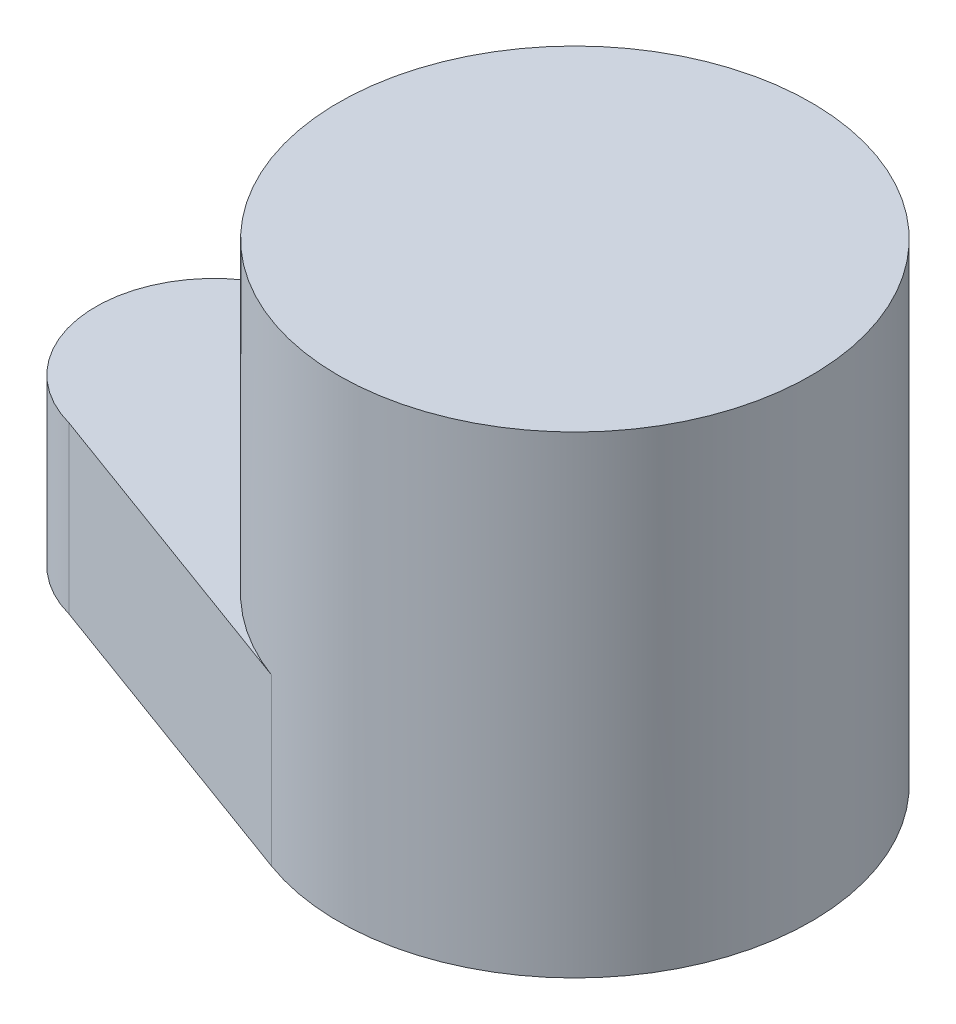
ISO-10303-21;
HEADER;
FILE_DESCRIPTION(('STEP AP214'),'2;1');
FILE_NAME('part.step','',(''),(''),'','','');
FILE_SCHEMA(('AUTOMOTIVE_DESIGN { 1 0 10303 214 1 1 1 1 }'));
ENDSEC;
DATA;
#1=APPLICATION_CONTEXT('core data for automotive mechanical design processes');
#2=APPLICATION_PROTOCOL_DEFINITION('international standard','automotive_design',2000,#1);
#3=PRODUCT_CONTEXT('',#1,'mechanical');
#4=PRODUCT('Part','Part','',(#3));
#5=PRODUCT_RELATED_PRODUCT_CATEGORY('part','',(#4));
#6=PRODUCT_DEFINITION_FORMATION('','',#4);
#7=PRODUCT_DEFINITION_CONTEXT('part definition',#1,'design');
#8=PRODUCT_DEFINITION('design','',#6,#7);
#9=PRODUCT_DEFINITION_SHAPE('','',#8);
#10=(LENGTH_UNIT() NAMED_UNIT(*) SI_UNIT(.MILLI.,.METRE.));
#11=(NAMED_UNIT(*) PLANE_ANGLE_UNIT() SI_UNIT($,.RADIAN.));
#12=(NAMED_UNIT(*) SI_UNIT($,.STERADIAN.) SOLID_ANGLE_UNIT());
#13=UNCERTAINTY_MEASURE_WITH_UNIT(LENGTH_MEASURE(1.E-05),#10,'distance_accuracy_value','');
#14=(GEOMETRIC_REPRESENTATION_CONTEXT(3) GLOBAL_UNCERTAINTY_ASSIGNED_CONTEXT((#13)) GLOBAL_UNIT_ASSIGNED_CONTEXT((#10,
#11,#12)) REPRESENTATION_CONTEXT('',''));
#15=CARTESIAN_POINT('',(0.,0.,0.));
#16=DIRECTION('',(0.,0.,1.));
#17=DIRECTION('',(1.,0.,0.));
#18=AXIS2_PLACEMENT_3D('',#15,#16,#17);
#19=CARTESIAN_POINT('',(46.2336617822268,100.,1.9433603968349));
#20=DIRECTION('',(0.,-1.,0.));
#21=DIRECTION('',(0.,0.,-1.));
#22=AXIS2_PLACEMENT_3D('',#19,#20,#21);
#23=CYLINDRICAL_SURFACE('',#22,49.9999999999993);
#24=CARTESIAN_POINT('',(46.2336617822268,100.,1.9433603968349));
#25=DIRECTION('',(0.,1.,0.));
#26=DIRECTION('',(0.,0.,1.));
#27=AXIS2_PLACEMENT_3D('',#24,#25,#26);
#28=CIRCLE('',#27,49.9999999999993);
#29=CARTESIAN_POINT('',(46.2336617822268,100.,51.9433603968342));
#30=VERTEX_POINT('',#29);
#31=EDGE_CURVE('E11',#30,#30,#28,.T.);
#32=ORIENTED_EDGE('',*,*,#31,.F.);
#33=EDGE_LOOP('',(#32));
#34=FACE_BOUND('',#33,.T.);
#35=DIRECTION('',(0.,-1.,0.));
#36=VECTOR('',#35,1.);
#37=CARTESIAN_POINT('',(31.438522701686,35.,-45.8175426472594));
#38=LINE('',#37,#36);
#39=CARTESIAN_POINT('',(31.438522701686,35.,-45.8175426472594));
#40=VERTEX_POINT('',#39);
#41=CARTESIAN_POINT('',(31.438522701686,0.,-45.8175426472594));
#42=VERTEX_POINT('',#41);
#43=EDGE_CURVE('E64',#40,#42,#38,.T.);
#44=ORIENTED_EDGE('',*,*,#43,.F.);
#45=CARTESIAN_POINT('',(46.2336617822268,35.,1.9433603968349));
#46=DIRECTION('',(0.,1.,0.));
#47=DIRECTION('',(0.,0.,1.));
#48=AXIS2_PLACEMENT_3D('',#45,#46,#47);
#49=CIRCLE('',#48,49.9999999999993);
#50=CARTESIAN_POINT('',(29.0353876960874,35.,48.892475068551));
#51=VERTEX_POINT('',#50);
#52=EDGE_CURVE('E59',#40,#51,#49,.T.);
#53=ORIENTED_EDGE('',*,*,#52,.T.);
#54=DIRECTION('',(0.,-1.,0.));
#55=VECTOR('',#54,1.);
#56=CARTESIAN_POINT('',(29.0353876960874,35.,48.892475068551));
#57=LINE('',#56,#55);
#58=CARTESIAN_POINT('',(29.0353876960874,0.,48.892475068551));
#59=VERTEX_POINT('',#58);
#60=EDGE_CURVE('E115',#51,#59,#57,.T.);
#61=ORIENTED_EDGE('',*,*,#60,.T.);
#62=CARTESIAN_POINT('',(46.2336617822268,0.,1.9433603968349));
#63=DIRECTION('',(0.,1.,0.));
#64=DIRECTION('',(0.,0.,1.));
#65=AXIS2_PLACEMENT_3D('',#62,#63,#64);
#66=CIRCLE('',#65,49.9999999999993);
#67=EDGE_CURVE('E48',#59,#42,#66,.T.);
#68=ORIENTED_EDGE('',*,*,#67,.T.);
#69=EDGE_LOOP('',(#44,#53,#61,#68));
#70=FACE_BOUND('',#69,.T.);
#71=ADVANCED_FACE('F45',(#34,#70),#23,.T.);
#72=CARTESIAN_POINT('',(46.2336617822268,100.,1.9433603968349));
#73=DIRECTION('',(0.,1.,0.));
#74=DIRECTION('',(0.,0.,1.));
#75=AXIS2_PLACEMENT_3D('',#72,#73,#74);
#76=PLANE('',#75);
#77=ORIENTED_EDGE('',*,*,#31,.T.);
#78=EDGE_LOOP('',(#77));
#79=FACE_BOUND('',#78,.T.);
#80=ADVANCED_FACE('F124',(#79),#76,.T.);
#81=CARTESIAN_POINT('',(46.2336617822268,0.,1.9433603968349));
#82=DIRECTION('',(0.,1.,0.));
#83=DIRECTION('',(0.,0.,1.));
#84=AXIS2_PLACEMENT_3D('',#81,#82,#83);
#85=PLANE('',#84);
#86=ORIENTED_EDGE('',*,*,#67,.F.);
#87=DIRECTION('',(0.938982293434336,0.,0.343965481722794));
#88=VECTOR('',#87,1.);
#89=CARTESIAN_POINT('',(-12.3559270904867,0.,33.7301193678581));
#90=LINE('',#89,#88);
#91=CARTESIAN_POINT('',(-38.5135043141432,0.,24.1481456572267));
#92=VERTEX_POINT('',#91);
#93=EDGE_CURVE('E104',#92,#59,#90,.T.);
#94=ORIENTED_EDGE('',*,*,#93,.F.);
#95=CARTESIAN_POINT('',(-32.0430281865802,0.,0.));
#96=DIRECTION('',(0.,1.,0.));
#97=DIRECTION('',(0.,0.,1.));
#98=AXIS2_PLACEMENT_3D('',#95,#96,#97);
#99=CIRCLE('',#98,25.);
#100=CARTESIAN_POINT('',(-38.5135043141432,0.,-24.1481456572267));
#101=VERTEX_POINT('',#100);
#102=EDGE_CURVE('E107',#101,#92,#99,.T.);
#103=ORIENTED_EDGE('',*,*,#102,.F.);
#104=DIRECTION('',(0.955218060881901,0.,-0.295902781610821));
#105=VECTOR('',#104,1.);
#106=CARTESIAN_POINT('',(-10.1976969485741,0.,-32.9196780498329));
#107=LINE('',#106,#105);
#108=EDGE_CURVE('E90',#101,#42,#107,.T.);
#109=ORIENTED_EDGE('',*,*,#108,.T.);
#110=EDGE_LOOP('',(#86,#94,#103,#109));
#111=FACE_BOUND('',#110,.T.);
#112=ADVANCED_FACE('F122',(#111),#85,.F.);
#113=CARTESIAN_POINT('',(-10.1976969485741,35.,-32.9196780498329));
#114=DIRECTION('',(-0.295902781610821,0.,-0.955218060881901));
#115=DIRECTION('',(-0.955218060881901,0.,0.295902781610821));
#116=AXIS2_PLACEMENT_3D('',#113,#114,#115);
#117=PLANE('',#116);
#118=ORIENTED_EDGE('',*,*,#108,.F.);
#119=DIRECTION('',(0.,-1.,0.));
#120=VECTOR('',#119,1.);
#121=CARTESIAN_POINT('',(-38.5135043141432,35.,-24.1481456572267));
#122=LINE('',#121,#120);
#123=CARTESIAN_POINT('',(-38.5135043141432,35.,-24.1481456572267));
#124=VERTEX_POINT('',#123);
#125=EDGE_CURVE('E84',#124,#101,#122,.T.);
#126=ORIENTED_EDGE('',*,*,#125,.F.);
#127=DIRECTION('',(0.955218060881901,0.,-0.295902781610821));
#128=VECTOR('',#127,1.);
#129=CARTESIAN_POINT('',(-10.1976969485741,35.,-32.9196780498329));
#130=LINE('',#129,#128);
#131=EDGE_CURVE('E88',#124,#40,#130,.T.);
#132=ORIENTED_EDGE('',*,*,#131,.T.);
#133=ORIENTED_EDGE('',*,*,#43,.T.);
#134=EDGE_LOOP('',(#118,#126,#132,#133));
#135=FACE_BOUND('',#134,.T.);
#136=ADVANCED_FACE('F86',(#135),#117,.T.);
#137=CARTESIAN_POINT('',(-32.0430281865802,35.,0.));
#138=DIRECTION('',(0.,-1.,0.));
#139=DIRECTION('',(0.,0.,-1.));
#140=AXIS2_PLACEMENT_3D('',#137,#138,#139);
#141=CYLINDRICAL_SURFACE('',#140,25.);
#142=ORIENTED_EDGE('',*,*,#102,.T.);
#143=DIRECTION('',(0.,-1.,0.));
#144=VECTOR('',#143,1.);
#145=CARTESIAN_POINT('',(-38.5135043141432,35.,24.1481456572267));
#146=LINE('',#145,#144);
#147=CARTESIAN_POINT('',(-38.5135043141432,35.,24.1481456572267));
#148=VERTEX_POINT('',#147);
#149=EDGE_CURVE('E93',#148,#92,#146,.T.);
#150=ORIENTED_EDGE('',*,*,#149,.F.);
#151=CARTESIAN_POINT('',(-32.0430281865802,35.,0.));
#152=DIRECTION('',(0.,1.,0.));
#153=DIRECTION('',(0.,0.,1.));
#154=AXIS2_PLACEMENT_3D('',#151,#152,#153);
#155=CIRCLE('',#154,25.);
#156=EDGE_CURVE('E96',#124,#148,#155,.T.);
#157=ORIENTED_EDGE('',*,*,#156,.F.);
#158=ORIENTED_EDGE('',*,*,#125,.T.);
#159=EDGE_LOOP('',(#142,#150,#157,#158));
#160=FACE_BOUND('',#159,.T.);
#161=ADVANCED_FACE('F97',(#160),#141,.T.);
#162=CARTESIAN_POINT('',(-12.3559270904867,35.,33.7301193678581));
#163=DIRECTION('',(0.343965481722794,0.,-0.938982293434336));
#164=DIRECTION('',(-0.938982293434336,0.,-0.343965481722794));
#165=AXIS2_PLACEMENT_3D('',#162,#163,#164);
#166=PLANE('',#165);
#167=ORIENTED_EDGE('',*,*,#93,.T.);
#168=ORIENTED_EDGE('',*,*,#60,.F.);
#169=DIRECTION('',(0.938982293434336,0.,0.343965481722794));
#170=VECTOR('',#169,1.);
#171=CARTESIAN_POINT('',(-12.3559270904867,35.,33.7301193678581));
#172=LINE('',#171,#170);
#173=EDGE_CURVE('E101',#148,#51,#172,.T.);
#174=ORIENTED_EDGE('',*,*,#173,.F.);
#175=ORIENTED_EDGE('',*,*,#149,.T.);
#176=EDGE_LOOP('',(#167,#168,#174,#175));
#177=FACE_BOUND('',#176,.T.);
#178=ADVANCED_FACE('F119',(#177),#166,.F.);
#179=CARTESIAN_POINT('',(0.,35.,0.));
#180=DIRECTION('',(0.,1.,0.));
#181=DIRECTION('',(0.,0.,1.));
#182=AXIS2_PLACEMENT_3D('',#179,#180,#181);
#183=PLANE('',#182);
#184=ORIENTED_EDGE('',*,*,#131,.F.);
#185=ORIENTED_EDGE('',*,*,#156,.T.);
#186=ORIENTED_EDGE('',*,*,#173,.T.);
#187=ORIENTED_EDGE('',*,*,#52,.F.);
#188=EDGE_LOOP('',(#184,#185,#186,#187));
#189=FACE_BOUND('',#188,.T.);
#190=ADVANCED_FACE('F103',(#189),#183,.T.);
#191=CLOSED_SHELL('',(#71,#80,#112,#136,#161,#178,#190));
#192=MANIFOLD_SOLID_BREP('B2',#191);
#193=ADVANCED_BREP_SHAPE_REPRESENTATION('',(#18,#192),#14);
#194=SHAPE_DEFINITION_REPRESENTATION(#9,#193);
ENDSEC;
END-ISO-10303-21;
